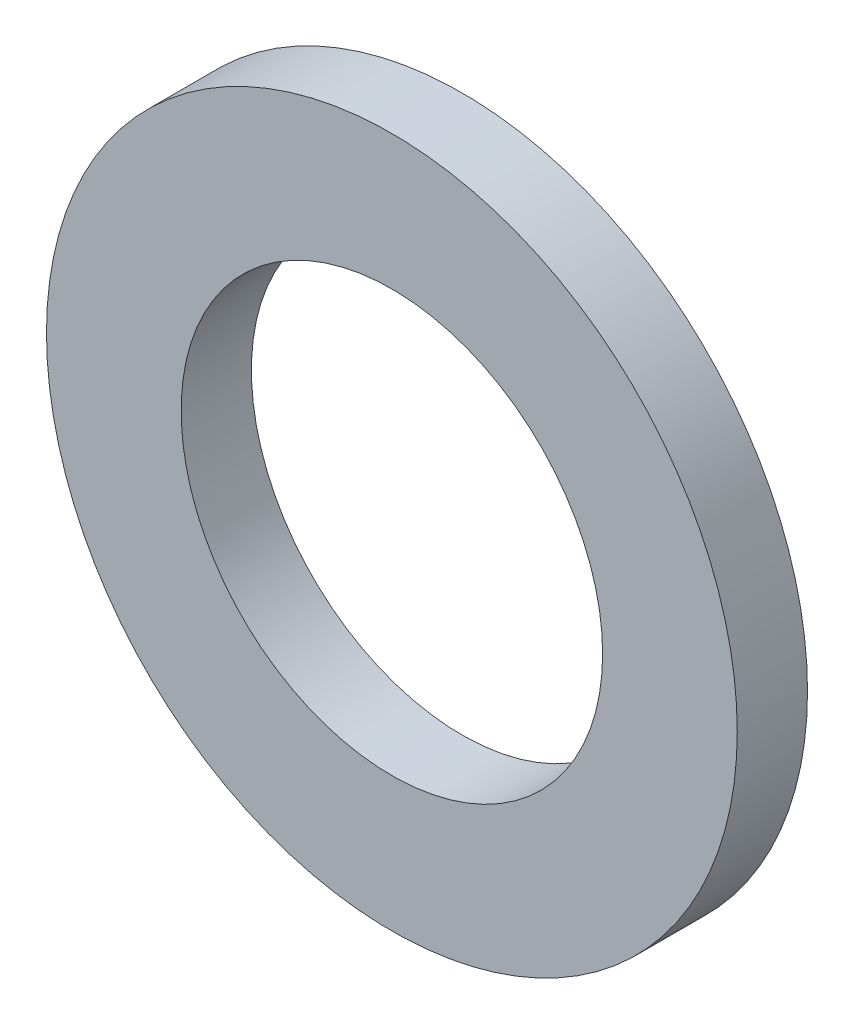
from build123d import *

# Parameters (mm, degrees)
ESQUISSE1_R      = 14.75
ESQUISSE1_R_2    = 9
EXTRUSION1_DEPTH = 3


with BuildPart() as part:
    # Esquisse1 → Extrusion1 (new body)
    with BuildSketch(Plane.XY):
        Circle(ESQUISSE1_R)
        Circle(ESQUISSE1_R_2, mode=Mode.SUBTRACT)
    extrude(amount=EXTRUSION1_DEPTH)


solid = part.part
